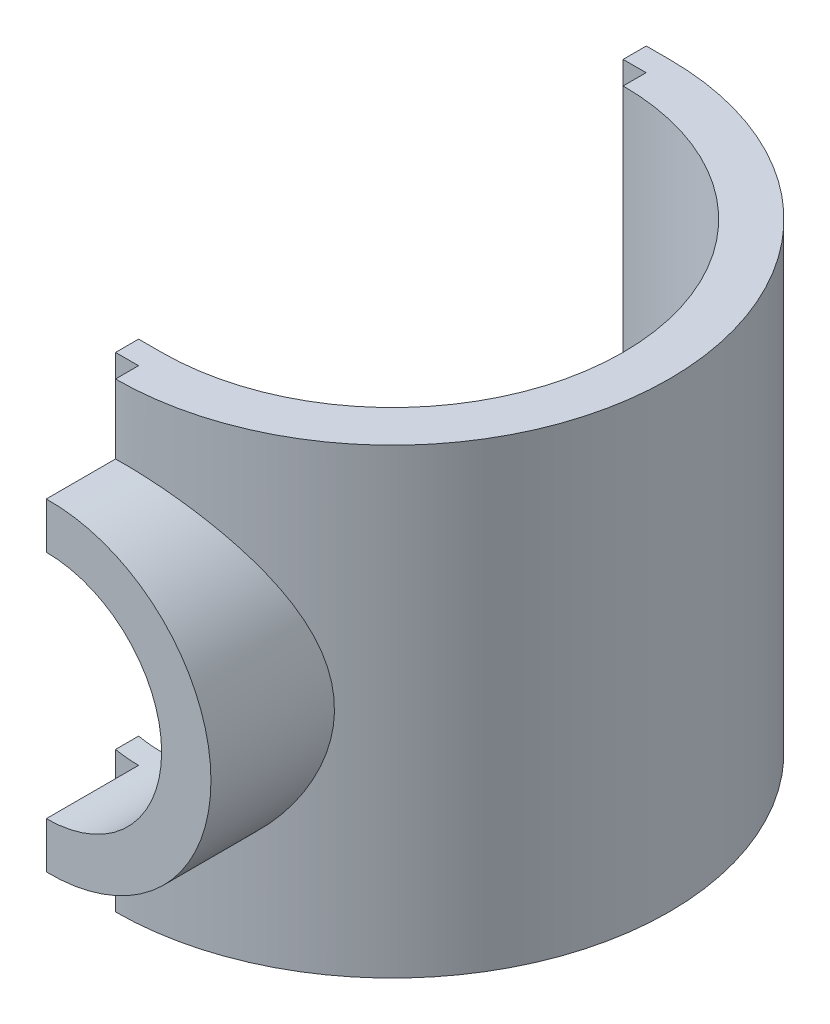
from build123d import *

# Parameters (mm, degrees)
BOSS_EXTRUDE1_DEPTH                  = 20
BOSS_EXTRUDE2_DEPTH                  = 3
BOSS_EXTRUDE2_DIRECTION_2_REACH      = 35.466
BOSS_EXTRUDE2_DIRECTION_2_END_RADIUS = 12
SKETCH5_W                            = 0.997263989
SKETCH5_H                            = 1.004869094
SKETCH5_H_2                          = 0.999562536
BOSS_EXTRUDE3_DEPTH                  = 20
CUT_EXTRUDE1_START                   = -13
SKETCH4_R                            = 5
CUT_EXTRUDE1_DEPTH                   = 13


with BuildPart() as part:
    # Sketch1 → Boss-Extrude1 (new body)
    with BuildSketch(Plane(origin=(0, 0, 0), x_dir=(1, 0, 0), z_dir=(0, 1, 0))):
        with BuildLine():
            Line((0, 10), (0, 12))
            ThreePointArc((0, 12), (12, 0), (0, -12))
            Line((0, -12), (0, -10))
            ThreePointArc((0, -10), (10, 0), (0, 10))
        make_face()
    extrude(amount=BOSS_EXTRUDE1_DEPTH)

    # Sketch3 → Boss-Extrude2 (add)
    with BuildSketch(Plane.XY.offset(12)):
        with BuildLine():
            Line((0, 16.998648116), (0, 15))
            ThreePointArc((0, 15), (5, 10), (0, 5))
            Line((0, 5), (0, 3.001351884))
            ThreePointArc((0, 3.001351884), (7.137566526, 10), (0, 16.998648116))
        make_face()
    extrude(amount=BOSS_EXTRUDE2_DEPTH)

    # Boss-Extrude2 direction 2: up to this cylinder (the profile starts outside it)
    boss_extrude2_direction_2_end = Plane(origin=(0, 10, 0), z_dir=(0, -1, 0)) * Cylinder(BOSS_EXTRUDE2_DIRECTION_2_END_RADIUS, 95.932, mode=Mode.PRIVATE)
    # Sketch3 → Boss-Extrude2 direction 2 (add, up to the surface)
    with BuildSketch(Plane.XY.offset(12), mode=Mode.PRIVATE) as boss_extrude2_direction_2_sk1:
        with BuildLine():
            Line((0, 16.998648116), (0, 15))
            ThreePointArc((0, 15), (5, 10), (0, 5))
            Line((0, 5), (0, 3.001351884))
            ThreePointArc((0, 3.001351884), (7.137566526, 10), (0, 16.998648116))
        make_face()
    boss_extrude2_direction_2_tool1 = extrude(boss_extrude2_direction_2_sk1.sketch, amount=-BOSS_EXTRUDE2_DIRECTION_2_REACH, mode=Mode.PRIVATE) - boss_extrude2_direction_2_end
    add(boss_extrude2_direction_2_tool1.solids().sort_by_distance((6.980422, 10, 12))[0])

    # Sketch5 → Boss-Extrude3 (add)
    with BuildSketch(Plane(origin=(0, 0, 0), x_dir=(1, 0, 0), z_dir=(0, 1, 0))):
        with Locations((-0.498631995, 11.497565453)):
            Rectangle(SKETCH5_W, SKETCH5_H)
        with Locations((-0.498631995, -10.499781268)):
            Rectangle(SKETCH5_W, SKETCH5_H_2)
    extrude(amount=BOSS_EXTRUDE3_DEPTH)

    # Sketch4 → Cut-Extrude1 (cut)
    with BuildSketch(Plane.XY.offset(12).offset(CUT_EXTRUDE1_START)):
        with Locations((0, 10)):
            Circle(SKETCH4_R)
    extrude(amount=CUT_EXTRUDE1_DEPTH, mode=Mode.SUBTRACT)


solid = part.part
